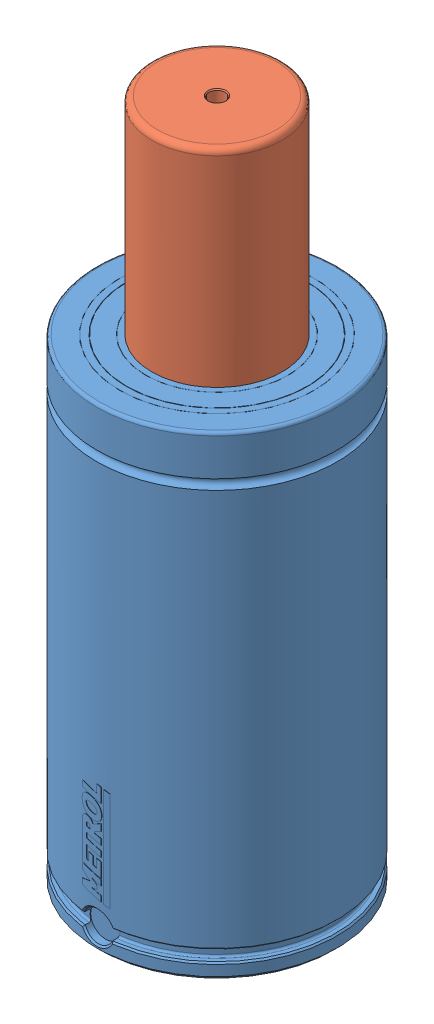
SolidWorks assembly ISNG5000-100.SLDASM, configuration Default (file format 7000). Lengths in mm.
Overall size (120 340 120.11).
2 component instances, 2 part files, 5 mates.
Components (placement in the parent):
- ISNG-5000 Body-1: ISNG-5000 Body.SLDPRT [ISNG-5000-100] x (0 0 1) z (0 -1 0) size (120.11 120 237)
- ISNG-5000 Piston-1: ISNG-5000 Piston.SLDPRT [ISNG-5000-100] at (0 212 0) x (0.647701 0 0.761894) z (0 -1 0) size (85 85 128)
Mates (geometry in assembly coordinates):
- Concentric1: concentric aligned: cylinder of ISNG-5000 Body-1 through (0 0 0) axis (0 -1 0) radius 32.5; cylinder of ISNG-5000 Piston-1 through (0 212 0) axis (0 -1 0) radius 32.5
- LimitDistance2: limit distance anti-aligned: plane of ISNG-5000 Body-1 through (-32.5 217 0) normal (0 -1 0); plane of ISNG-5000 Piston-1 through (-32.3805 217 27.5273) normal (0 1 0)
- Coincident1: coincident anti-aligned: plane of ISNG-5000 Body-1 through (0 0 0) normal (0 -1 0); plane of assembly through (0 0 0) normal (0 1 0)
- Coincident2: coincident anti-aligned: plane of ISNG-5000 Body-1; plane of assembly through (0 0 0) normal (1 0 0)
- Coincident4: coincident aligned: plane of ISNG-5000 Body-1; plane of assembly through (0 0 0) normal (0 0 1)
